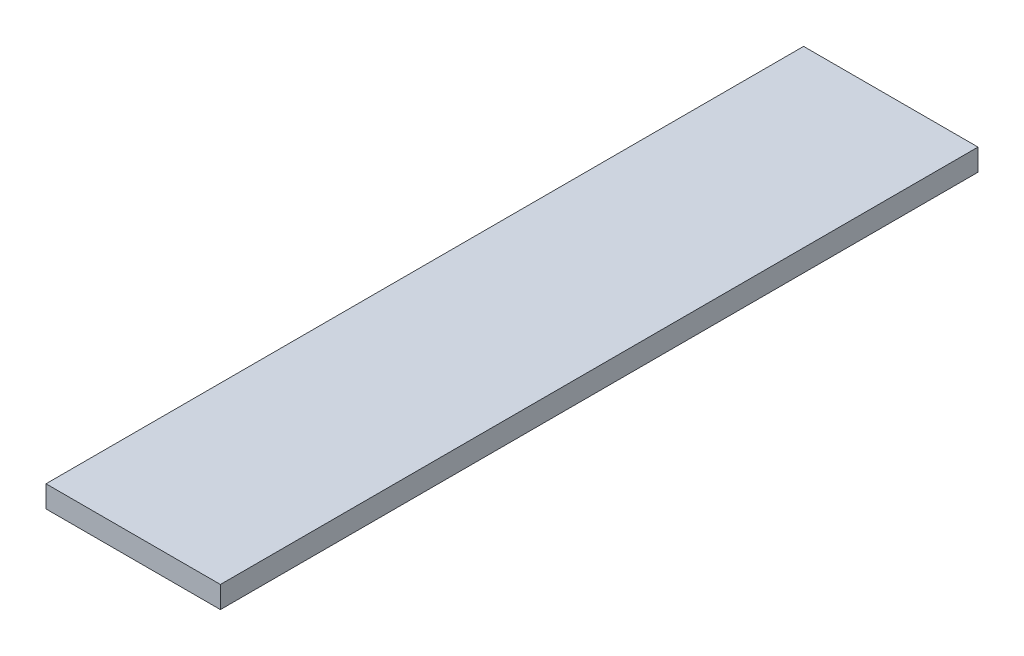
from build123d import *

# Parameters (mm, degrees)
SKETCH1_W           = 50.8
SKETCH1_H           = 220.6625
BOSS_EXTRUDE1_DEPTH = 6.35


with BuildPart() as part:
    # Sketch1 → Boss-Extrude1 (new body)
    with BuildSketch(Plane(origin=(0, 0, 0), x_dir=(1, 0, 0), z_dir=(0, 1, 0))):
        Rectangle(SKETCH1_W, SKETCH1_H)
    extrude(amount=BOSS_EXTRUDE1_DEPTH)


solid = part.part
